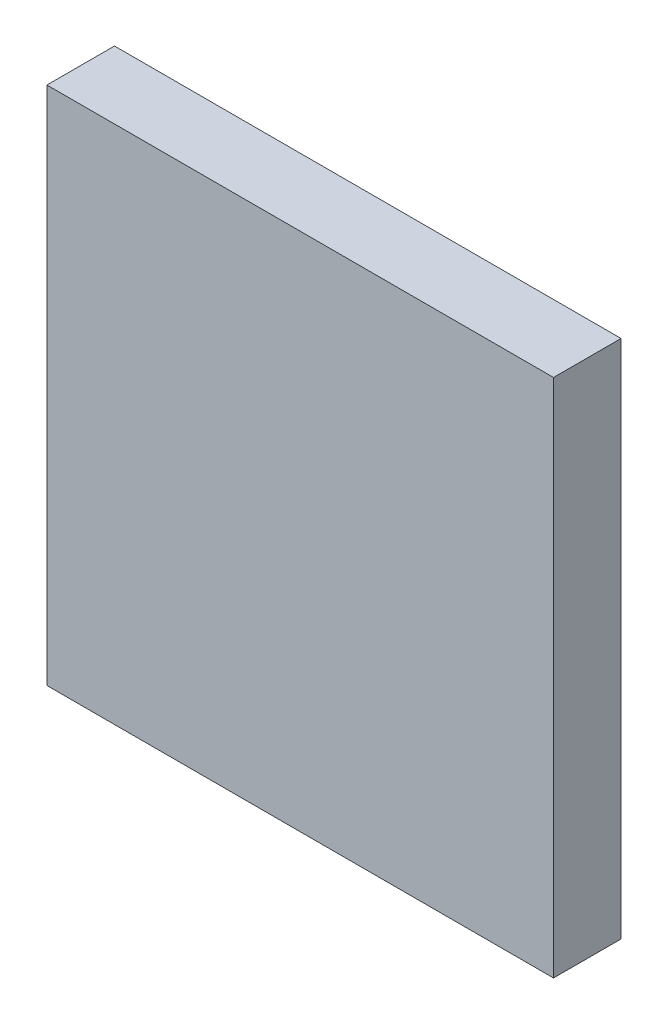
from build123d import *

# Parameters (mm, degrees)
ESQUISSE1_W        = 150
ESQUISSE1_H        = 154
BOSS_EXTRU_1_DEPTH = 20


with BuildPart() as part:
    # Esquisse1 → Boss.-Extru.1 (new body)
    with BuildSketch(Plane.XY):
        with Locations((-27.739073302, -15.365181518)):
            Rectangle(ESQUISSE1_W, ESQUISSE1_H)
    extrude(amount=BOSS_EXTRU_1_DEPTH)


solid = part.part
